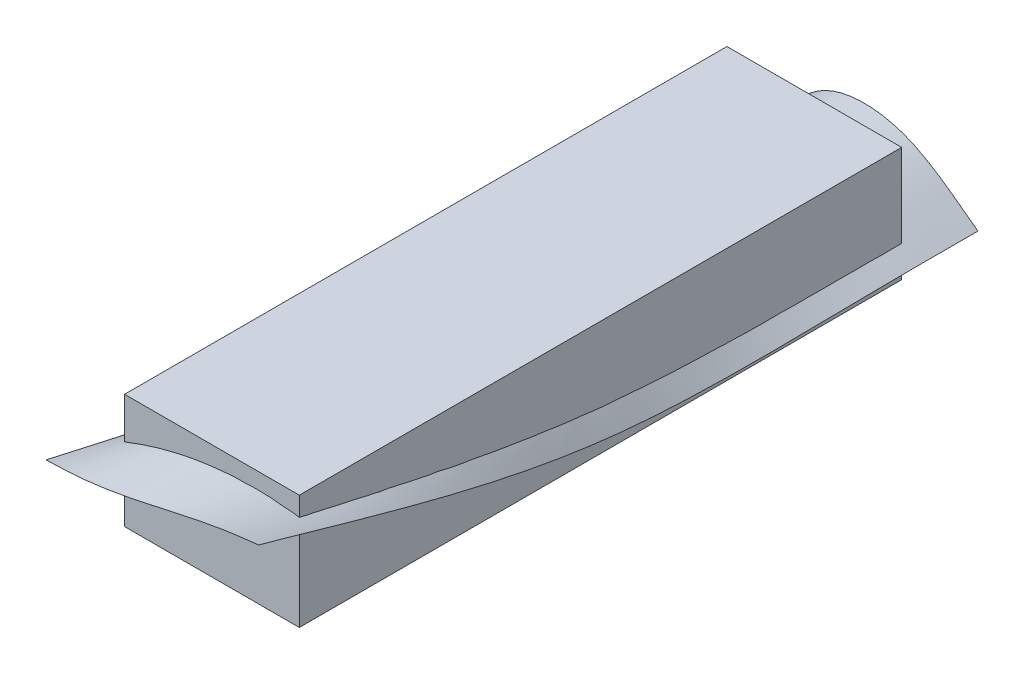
from build123d import *

# Parameters (mm, degrees)
SKETCH1_W      = 91.738204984
SKETCH1_H      = 60.170985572
EXTRUDE1_DEPTH = 316.23


with BuildPart() as part:
    # Sketch1 → Extrude1 (new body)
    with BuildSketch(Plane.XY):
        with Locations((45.869102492, 30.085492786)):
            Rectangle(SKETCH1_W, SKETCH1_H)
    extrude(amount=EXTRUDE1_DEPTH)


solid = part.part
